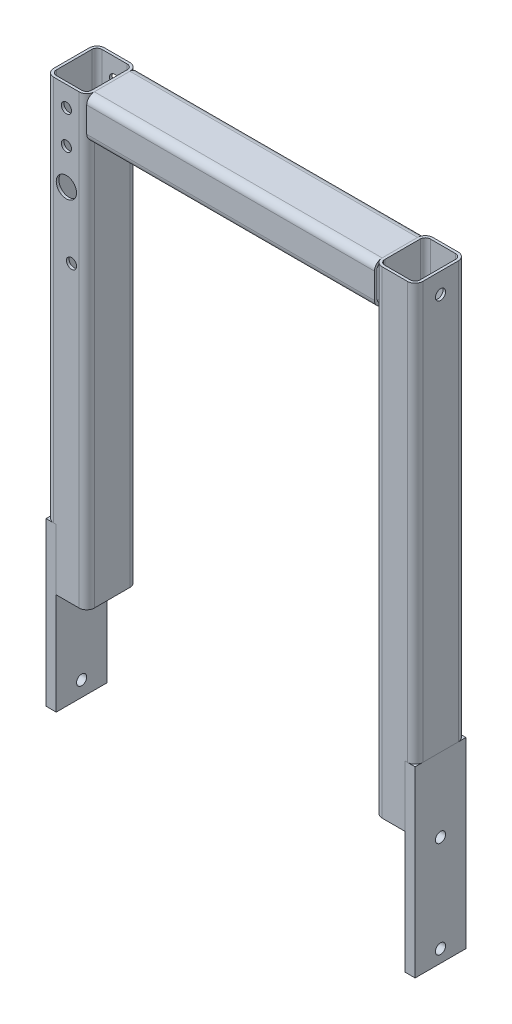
from build123d import *

# Parameters (mm, degrees)
SKETCH2_W             = 179.832
SKETCH2_H             = 25.4
BOSS_EXTRUDE1_DEPTH   = 15.875
FILLET1_R             = 4.7752
SHELL1_T              = -1.651
BOSS_EXTRUDE2_DEPTH   = 15.875
BOSS_EXTRUDE2_2_DEPTH = 15.875
FILLET2_R             = 4.7752
FILLET3_R             = 4.7752
SHELL3_T              = -1.651
SHELL4_T              = -1.651
SKETCH4_W             = 6.35
SKETCH4_H             = 38.1
CUT_EXTRUDE1_DEPTH    = 25.4
BOSS_EXTRUDE3_DEPTH   = 15.875
BOSS_EXTRUDE3_2_DEPTH = 15.875
SKETCH6_R             = 3.175
CUT_EXTRUDE2_DEPTH    = 152.4
SKETCH7_R             = 3.175
CUT_EXTRUDE3_DEPTH    = 152.4
SKETCH8_R             = 3.175
CUT_EXTRUDE4_DEPTH    = 30.48
SKETCH9_R             = 6.35
CUT_EXTRUDE6_DEPTH    = 30.48
SKETCH10_R            = 3.175
CUT_EXTRUDE7_DEPTH    = 22.86
CUT_EXTRUDE8_START    = 99.06
SKETCH11_R            = 3.175
CUT_EXTRUDE8_DEPTH    = 20.32


with BuildPart() as part:
    # Sketch2 → Boss-Extrude1 (new, symmetric)
    with BuildSketch(Plane.XY):
        with Locations((-4.826, 266.7)):
            Rectangle(SKETCH2_W, SKETCH2_H)
    extrude(amount=BOSS_EXTRUDE1_DEPTH, both=True)

    # Fillet1
    fillet1_edges = [part.edges().sort_by_distance(p)[0] for p in [
        (-4.826, 279.4, 15.875),
        (-4.826, 279.4, -15.875),
        (-4.826, 254, -15.875),
        (-4.826, 254, 15.875),
    ]]
    fillet(fillet1_edges, radius=FILLET1_R)

    # Shell1
    shell1_openings = [part.faces().sort_by_distance(p)[0] for p in [
        (85.09, 266.7, 0),
        (-94.742, 266.7, 0),
    ]]
    offset(amount=SHELL1_T, openings=shell1_openings, kind=Kind.INTERSECTION)


with BuildPart() as body_2:
    # Sketch3 → Boss-Extrude2 (new, symmetric)
    with BuildSketch(Plane.XY):
        Polygon((-120.142, 0), (-94.742, 0), (-94.742, 254), (-94.742, 279.4), (-120.142, 279.4), align=None)
    extrude(amount=BOSS_EXTRUDE2_DEPTH, both=True)

    # Fillet2
    fillet2_edges = [body_2.edges().sort_by_distance(p)[0] for p in [
        (-94.742, 139.7, 15.875),
        (-120.142, 139.7, 15.875),
        (-94.742, 139.7, -15.875),
        (-120.142, 139.7, -15.875),
    ]]
    fillet(fillet2_edges, radius=FILLET2_R)

    # Shell3
    shell3_openings = [body_2.faces().sort_by_distance(p)[0] for p in [
        (-107.442, 0, 0),
        (-107.442, 279.4, 0),
    ]]
    offset(amount=SHELL3_T, openings=shell3_openings, kind=Kind.INTERSECTION)


with BuildPart() as body_3:
    # Sketch3 → Boss-Extrude2 2 (new, symmetric)
    with BuildSketch(Plane.XY):
        Polygon((110.49, 279.4), (85.09, 279.4), (85.09, 254), (85.09, -19.05), (110.49, -19.05), align=None)
    extrude(amount=BOSS_EXTRUDE2_2_DEPTH, both=True)

    # Fillet3
    fillet3_edges = [body_3.edges().sort_by_distance(p)[0] for p in [
        (85.09, 130.175, 15.875),
        (110.49, 130.175, 15.875),
        (85.09, 130.175, -15.875),
        (110.49, 130.175, -15.875),
    ]]
    fillet(fillet3_edges, radius=FILLET3_R)

    # Shell4
    shell4_openings = [body_3.faces().sort_by_distance(p)[0] for p in [
        (97.79, 279.4, 0),
        (97.79, -19.05, 0),
    ]]
    offset(amount=SHELL4_T, openings=shell4_openings, kind=Kind.INTERSECTION)


with BuildPart() as cut_extrude1_tool:
    # Sketch4 → Cut-Extrude1 (new, symmetric)
    with BuildSketch(Plane.XY):
        with Locations((-116.967, 19.05)):
            Rectangle(SKETCH4_W, SKETCH4_H)
        Polygon((110.49, -19.05), (110.49, 19.05), (104.14, 19.05), (104.14, -95.25), (110.49, -95.25), align=None)
    extrude(amount=CUT_EXTRUDE1_DEPTH, both=True)


with BuildPart() as body_2_1:
    add(body_2.part)

    # Cut-Extrude1: cut by cut_extrude1_tool
    add(cut_extrude1_tool.part, mode=Mode.SUBTRACT)

    # Sketch8 → Cut-Extrude4 (cut)
    with BuildSketch(Plane.XY):
        with Locations((-107.442, 223.8248)):
            Circle(SKETCH8_R)
    extrude(amount=-CUT_EXTRUDE4_DEPTH, mode=Mode.SUBTRACT)

    # Sketch9 → Cut-Extrude6 (cut)
    with BuildSketch(Plane.XY):
        with Locations(Location((-107.442, 223.8248, 0), (0, 0, 180))):
            Circle(SKETCH9_R)
    extrude(amount=CUT_EXTRUDE6_DEPTH, mode=Mode.SUBTRACT)

    # Sketch10 → Cut-Extrude7 (cut, symmetric)
    with BuildSketch(Plane.XY):
        with Locations((-104.267, 184.15)):
            Circle(SKETCH10_R)
        with Locations((-107.442, 266.7)):
            Circle(SKETCH10_R)
        with Locations((-107.442, 246.0498)):
            Circle(SKETCH10_R)
    extrude(amount=CUT_EXTRUDE7_DEPTH, both=True, mode=Mode.SUBTRACT)


with BuildPart() as body_3_1:
    add(body_3.part)

    # Cut-Extrude1: cut by cut_extrude1_tool
    add(cut_extrude1_tool.part, mode=Mode.SUBTRACT)

    # Sketch11 → Cut-Extrude8 (cut)
    with BuildSketch(Plane(origin=(0, 0, 0), x_dir=(0, 0, -1), z_dir=(1, 0, 0)).offset(CUT_EXTRUDE8_START)):
        with Locations(Location((0, 266.7, 0), (0, 0, 180))):
            Circle(SKETCH11_R)
    extrude(amount=CUT_EXTRUDE8_DEPTH, mode=Mode.SUBTRACT)


with BuildPart() as body_4:
    # Sketch5 → Boss-Extrude3 (new, symmetric)
    with BuildSketch(Plane.XY):
        Polygon((-113.792, -63.5), (-120.142, -63.5), (-120.142, 0), (-120.142, 38.1), (-113.792, 38.1), (-113.792, 0), align=None)
    extrude(amount=BOSS_EXTRUDE3_DEPTH, both=True)

    # Sketch7 → Cut-Extrude3 (cut)
    with BuildSketch(Plane(origin=(0, 0, 0), x_dir=(0, 0, -1), z_dir=(1, 0, 0))):
        with Locations((0, -9.525)):
            Circle(SKETCH7_R)
        with Locations((0, -53.975)):
            Circle(SKETCH7_R)
    extrude(amount=-CUT_EXTRUDE3_DEPTH, mode=Mode.SUBTRACT)


with BuildPart() as body_5:
    # Sketch5 → Boss-Extrude3 2 (new, symmetric)
    with BuildSketch(Plane.XY):
        Polygon((104.14, 19.05), (104.14, -95.25), (110.49, -95.25), (110.49, -19.05), (110.49, 19.05), align=None)
    extrude(amount=BOSS_EXTRUDE3_2_DEPTH, both=True)

    # Sketch6 → Cut-Extrude2 (cut)
    with BuildSketch(Plane(origin=(0, 0, 0), x_dir=(0, 0, -1), z_dir=(1, 0, 0))):
        with Locations(Location((0, -87.3252, 0), (0, 0, 180))):
            Circle(SKETCH6_R)
        with Locations(Location((0, -27.0002, 0), (0, 0, 180))):
            Circle(SKETCH6_R)
    extrude(amount=CUT_EXTRUDE2_DEPTH, mode=Mode.SUBTRACT)


solid = Compound([part.part, body_2_1.part, body_3_1.part, body_4.part, body_5.part])
